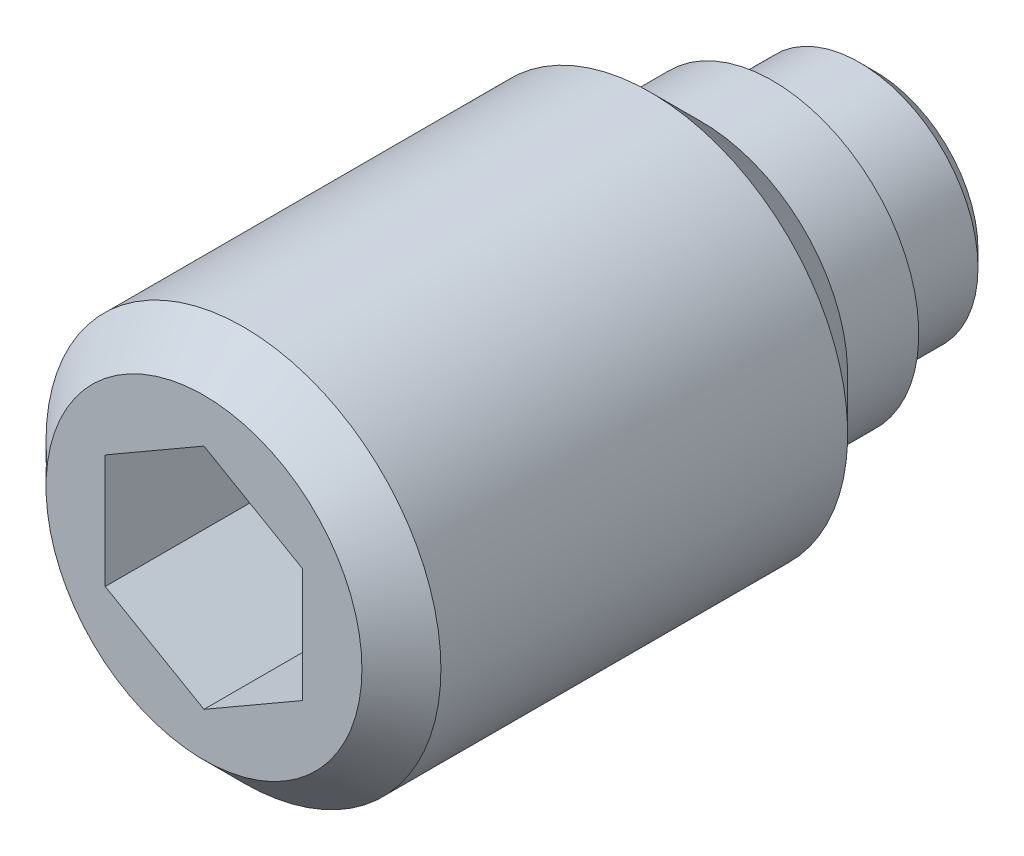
ISO-10303-21;
HEADER;
FILE_DESCRIPTION(('STEP AP214'),'2;1');
FILE_NAME('part.step','',(''),(''),'','','');
FILE_SCHEMA(('AUTOMOTIVE_DESIGN { 1 0 10303 214 1 1 1 1 }'));
ENDSEC;
DATA;
#1=APPLICATION_CONTEXT('core data for automotive mechanical design processes');
#2=APPLICATION_PROTOCOL_DEFINITION('international standard','automotive_design',2000,#1);
#3=PRODUCT_CONTEXT('',#1,'mechanical');
#4=PRODUCT('Part','Part','',(#3));
#5=PRODUCT_RELATED_PRODUCT_CATEGORY('part','',(#4));
#6=PRODUCT_DEFINITION_FORMATION('','',#4);
#7=PRODUCT_DEFINITION_CONTEXT('part definition',#1,'design');
#8=PRODUCT_DEFINITION('design','',#6,#7);
#9=PRODUCT_DEFINITION_SHAPE('','',#8);
#10=(LENGTH_UNIT() NAMED_UNIT(*) SI_UNIT(.MILLI.,.METRE.));
#11=(NAMED_UNIT(*) PLANE_ANGLE_UNIT() SI_UNIT($,.RADIAN.));
#12=(NAMED_UNIT(*) SI_UNIT($,.STERADIAN.) SOLID_ANGLE_UNIT());
#13=UNCERTAINTY_MEASURE_WITH_UNIT(LENGTH_MEASURE(1.E-05),#10,'distance_accuracy_value','');
#14=(GEOMETRIC_REPRESENTATION_CONTEXT(3) GLOBAL_UNCERTAINTY_ASSIGNED_CONTEXT((#13)) GLOBAL_UNIT_ASSIGNED_CONTEXT((#10,
#11,#12)) REPRESENTATION_CONTEXT('',''));
#15=CARTESIAN_POINT('',(0.,0.,0.));
#16=DIRECTION('',(0.,0.,1.));
#17=DIRECTION('',(1.,0.,0.));
#18=AXIS2_PLACEMENT_3D('',#15,#16,#17);
#19=CARTESIAN_POINT('',(0.,0.,1.3));
#20=DIRECTION('',(0.,0.,-1.));
#21=DIRECTION('',(-1.,0.,0.));
#22=AXIS2_PLACEMENT_3D('',#19,#20,#21);
#23=CYLINDRICAL_SURFACE('',#22,2.5);
#24=CARTESIAN_POINT('',(0.,0.,2.85));
#25=DIRECTION('',(0.,0.,-1.));
#26=DIRECTION('',(-1.,0.,0.));
#27=AXIS2_PLACEMENT_3D('',#24,#25,#26);
#28=CIRCLE('',#27,2.5);
#29=CARTESIAN_POINT('',(-2.5,0.,2.85));
#30=VERTEX_POINT('',#29);
#31=EDGE_CURVE('E9',#30,#30,#28,.T.);
#32=ORIENTED_EDGE('',*,*,#31,.F.);
#33=EDGE_LOOP('',(#32));
#34=FACE_BOUND('',#33,.T.);
#35=CARTESIAN_POINT('',(0.,0.,8.));
#36=DIRECTION('',(0.,0.,1.));
#37=DIRECTION('',(1.,0.,0.));
#38=AXIS2_PLACEMENT_3D('',#35,#36,#37);
#39=CIRCLE('',#38,2.5);
#40=CARTESIAN_POINT('',(2.5,0.,8.));
#41=VERTEX_POINT('',#40);
#42=EDGE_CURVE('E115',#41,#41,#39,.T.);
#43=ORIENTED_EDGE('',*,*,#42,.F.);
#44=EDGE_LOOP('',(#43));
#45=FACE_BOUND('',#44,.T.);
#46=ADVANCED_FACE('F14',(#34,#45),#23,.T.);
#47=CARTESIAN_POINT('',(0.,0.,2.85));
#48=DIRECTION('',(0.,0.,1.));
#49=DIRECTION('',(1.,0.,0.));
#50=AXIS2_PLACEMENT_3D('',#47,#48,#49);
#51=CONICAL_SURFACE('',#50,2.5,0.785398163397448);
#52=ORIENTED_EDGE('',*,*,#31,.T.);
#53=EDGE_LOOP('',(#52));
#54=FACE_BOUND('',#53,.T.);
#55=CARTESIAN_POINT('',(0.,0.,2.2));
#56=DIRECTION('',(0.,0.,-1.));
#57=DIRECTION('',(-1.,0.,0.));
#58=AXIS2_PLACEMENT_3D('',#55,#56,#57);
#59=CIRCLE('',#58,1.85);
#60=CARTESIAN_POINT('',(-1.85,0.,2.2));
#61=VERTEX_POINT('',#60);
#62=EDGE_CURVE('E21',#61,#61,#59,.T.);
#63=ORIENTED_EDGE('',*,*,#62,.F.);
#64=EDGE_LOOP('',(#63));
#65=FACE_BOUND('',#64,.T.);
#66=ADVANCED_FACE('F143',(#54,#65),#51,.T.);
#67=CARTESIAN_POINT('',(0.,0.,1.3));
#68=DIRECTION('',(0.,0.,-1.));
#69=DIRECTION('',(-1.,0.,0.));
#70=AXIS2_PLACEMENT_3D('',#67,#68,#69);
#71=CYLINDRICAL_SURFACE('',#70,1.85);
#72=ORIENTED_EDGE('',*,*,#62,.T.);
#73=EDGE_LOOP('',(#72));
#74=FACE_BOUND('',#73,.T.);
#75=CARTESIAN_POINT('',(0.,0.,1.3));
#76=DIRECTION('',(0.,0.,-1.));
#77=DIRECTION('',(-1.,0.,0.));
#78=AXIS2_PLACEMENT_3D('',#75,#76,#77);
#79=CIRCLE('',#78,1.85);
#80=CARTESIAN_POINT('',(-1.85,0.,1.3));
#81=VERTEX_POINT('',#80);
#82=EDGE_CURVE('E135',#81,#81,#79,.T.);
#83=ORIENTED_EDGE('',*,*,#82,.F.);
#84=EDGE_LOOP('',(#83));
#85=FACE_BOUND('',#84,.T.);
#86=ADVANCED_FACE('F140',(#74,#85),#71,.T.);
#87=CARTESIAN_POINT('',(0.,1.85,1.3));
#88=DIRECTION('',(0.,0.,1.));
#89=DIRECTION('',(1.,0.,0.));
#90=AXIS2_PLACEMENT_3D('',#87,#88,#89);
#91=PLANE('',#90);
#92=ORIENTED_EDGE('',*,*,#82,.T.);
#93=EDGE_LOOP('',(#92));
#94=FACE_BOUND('',#93,.T.);
#95=CARTESIAN_POINT('',(0.,0.,1.3));
#96=DIRECTION('',(0.,0.,-1.));
#97=DIRECTION('',(-1.,0.,0.));
#98=AXIS2_PLACEMENT_3D('',#95,#96,#97);
#99=CIRCLE('',#98,1.5);
#100=CARTESIAN_POINT('',(-1.5,0.,1.3));
#101=VERTEX_POINT('',#100);
#102=EDGE_CURVE('E132',#101,#101,#99,.T.);
#103=ORIENTED_EDGE('',*,*,#102,.F.);
#104=EDGE_LOOP('',(#103));
#105=FACE_BOUND('',#104,.T.);
#106=ADVANCED_FACE('F151',(#94,#105),#91,.F.);
#107=CARTESIAN_POINT('',(0.,0.,0.));
#108=DIRECTION('',(0.,0.,-1.));
#109=DIRECTION('',(-1.,0.,0.));
#110=AXIS2_PLACEMENT_3D('',#107,#108,#109);
#111=CYLINDRICAL_SURFACE('',#110,1.5);
#112=CARTESIAN_POINT('',(0.,0.,0.2));
#113=DIRECTION('',(0.,0.,-1.));
#114=DIRECTION('',(-1.,0.,0.));
#115=AXIS2_PLACEMENT_3D('',#112,#113,#114);
#116=CIRCLE('',#115,1.5);
#117=CARTESIAN_POINT('',(-1.5,0.,0.2));
#118=VERTEX_POINT('',#117);
#119=EDGE_CURVE('E129',#118,#118,#116,.T.);
#120=ORIENTED_EDGE('',*,*,#119,.F.);
#121=EDGE_LOOP('',(#120));
#122=FACE_BOUND('',#121,.T.);
#123=ORIENTED_EDGE('',*,*,#102,.T.);
#124=EDGE_LOOP('',(#123));
#125=FACE_BOUND('',#124,.T.);
#126=ADVANCED_FACE('F157',(#122,#125),#111,.T.);
#127=CARTESIAN_POINT('',(0.,0.,0.2));
#128=DIRECTION('',(0.,0.,1.));
#129=DIRECTION('',(1.,0.,0.));
#130=AXIS2_PLACEMENT_3D('',#127,#128,#129);
#131=CONICAL_SURFACE('',#130,1.5,0.785398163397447);
#132=CARTESIAN_POINT('',(0.,0.,0.));
#133=DIRECTION('',(0.,0.,-1.));
#134=DIRECTION('',(-1.,0.,0.));
#135=AXIS2_PLACEMENT_3D('',#132,#133,#134);
#136=CIRCLE('',#135,1.3);
#137=CARTESIAN_POINT('',(-1.3,0.,0.));
#138=VERTEX_POINT('',#137);
#139=EDGE_CURVE('E126',#138,#138,#136,.T.);
#140=ORIENTED_EDGE('',*,*,#139,.F.);
#141=EDGE_LOOP('',(#140));
#142=FACE_BOUND('',#141,.T.);
#143=ORIENTED_EDGE('',*,*,#119,.T.);
#144=EDGE_LOOP('',(#143));
#145=FACE_BOUND('',#144,.T.);
#146=ADVANCED_FACE('F161',(#142,#145),#131,.T.);
#147=CARTESIAN_POINT('',(0.,1.3,0.));
#148=DIRECTION('',(0.,0.,1.));
#149=DIRECTION('',(1.,0.,0.));
#150=AXIS2_PLACEMENT_3D('',#147,#148,#149);
#151=PLANE('',#150);
#152=ORIENTED_EDGE('',*,*,#139,.T.);
#153=EDGE_LOOP('',(#152));
#154=FACE_BOUND('',#153,.T.);
#155=ADVANCED_FACE('F165',(#154),#151,.F.);
#156=CARTESIAN_POINT('',(0.,0.,8.5));
#157=DIRECTION('',(0.,0.,1.));
#158=DIRECTION('',(1.,0.,0.));
#159=AXIS2_PLACEMENT_3D('',#156,#157,#158);
#160=PLANE('',#159);
#161=DIRECTION('',(0.866025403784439,-0.5,0.));
#162=VECTOR('',#161,1.);
#163=CARTESIAN_POINT('',(-1.25,-0.721687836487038,8.5));
#164=LINE('',#163,#162);
#165=CARTESIAN_POINT('',(-1.25,-0.721687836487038,8.5));
#166=VERTEX_POINT('',#165);
#167=CARTESIAN_POINT('',(0.,-1.44337567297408,8.5));
#168=VERTEX_POINT('',#167);
#169=EDGE_CURVE('E28',#166,#168,#164,.T.);
#170=ORIENTED_EDGE('',*,*,#169,.F.);
#171=DIRECTION('',(0.,-1.,0.));
#172=VECTOR('',#171,1.);
#173=CARTESIAN_POINT('',(-1.25,0.721687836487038,8.5));
#174=LINE('',#173,#172);
#175=CARTESIAN_POINT('',(-1.25,0.721687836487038,8.5));
#176=VERTEX_POINT('',#175);
#177=EDGE_CURVE('E111',#176,#166,#174,.T.);
#178=ORIENTED_EDGE('',*,*,#177,.F.);
#179=DIRECTION('',(-0.866025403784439,-0.5,0.));
#180=VECTOR('',#179,1.);
#181=CARTESIAN_POINT('',(0.,1.44337567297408,8.5));
#182=LINE('',#181,#180);
#183=CARTESIAN_POINT('',(0.,1.44337567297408,8.5));
#184=VERTEX_POINT('',#183);
#185=EDGE_CURVE('E109',#184,#176,#182,.T.);
#186=ORIENTED_EDGE('',*,*,#185,.F.);
#187=DIRECTION('',(-0.866025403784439,0.5,0.));
#188=VECTOR('',#187,1.);
#189=CARTESIAN_POINT('',(1.25,0.721687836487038,8.5));
#190=LINE('',#189,#188);
#191=CARTESIAN_POINT('',(1.25,0.721687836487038,8.5));
#192=VERTEX_POINT('',#191);
#193=EDGE_CURVE('E76',#192,#184,#190,.T.);
#194=ORIENTED_EDGE('',*,*,#193,.F.);
#195=DIRECTION('',(0.,1.,0.));
#196=VECTOR('',#195,1.);
#197=CARTESIAN_POINT('',(1.25,-0.721687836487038,8.5));
#198=LINE('',#197,#196);
#199=CARTESIAN_POINT('',(1.25,-0.721687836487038,8.5));
#200=VERTEX_POINT('',#199);
#201=EDGE_CURVE('E105',#200,#192,#198,.T.);
#202=ORIENTED_EDGE('',*,*,#201,.F.);
#203=DIRECTION('',(0.866025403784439,0.5,0.));
#204=VECTOR('',#203,1.);
#205=CARTESIAN_POINT('',(0.,-1.44337567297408,8.5));
#206=LINE('',#205,#204);
#207=EDGE_CURVE('E102',#168,#200,#206,.T.);
#208=ORIENTED_EDGE('',*,*,#207,.F.);
#209=EDGE_LOOP('',(#170,#178,#186,#194,#202,#208));
#210=FACE_BOUND('',#209,.T.);
#211=CARTESIAN_POINT('',(0.,0.,8.5));
#212=DIRECTION('',(0.,0.,1.));
#213=DIRECTION('',(1.,0.,0.));
#214=AXIS2_PLACEMENT_3D('',#211,#212,#213);
#215=CIRCLE('',#214,2.);
#216=CARTESIAN_POINT('',(2.,0.,8.5));
#217=VERTEX_POINT('',#216);
#218=EDGE_CURVE('E123',#217,#217,#215,.T.);
#219=ORIENTED_EDGE('',*,*,#218,.T.);
#220=EDGE_LOOP('',(#219));
#221=FACE_BOUND('',#220,.T.);
#222=ADVANCED_FACE('F169',(#210,#221),#160,.T.);
#223=CARTESIAN_POINT('',(0.,0.,8.5));
#224=DIRECTION('',(0.,0.,-1.));
#225=DIRECTION('',(-1.,0.,0.));
#226=AXIS2_PLACEMENT_3D('',#223,#224,#225);
#227=CONICAL_SURFACE('',#226,2.,0.785398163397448);
#228=ORIENTED_EDGE('',*,*,#42,.T.);
#229=EDGE_LOOP('',(#228));
#230=FACE_BOUND('',#229,.T.);
#231=ORIENTED_EDGE('',*,*,#218,.F.);
#232=EDGE_LOOP('',(#231));
#233=FACE_BOUND('',#232,.T.);
#234=ADVANCED_FACE('F173',(#230,#233),#227,.T.);
#235=CARTESIAN_POINT('',(-1.25,-0.721687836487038,5.5));
#236=DIRECTION('',(-0.5,-0.866025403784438,0.));
#237=DIRECTION('',(0.866025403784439,-0.5,0.));
#238=AXIS2_PLACEMENT_3D('',#235,#236,#237);
#239=PLANE('',#238);
#240=ORIENTED_EDGE('',*,*,#169,.T.);
#241=DIRECTION('',(0.,0.,1.));
#242=VECTOR('',#241,1.);
#243=CARTESIAN_POINT('',(0.,-1.44337567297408,5.5));
#244=LINE('',#243,#242);
#245=CARTESIAN_POINT('',(0.,-1.44337567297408,5.5));
#246=VERTEX_POINT('',#245);
#247=EDGE_CURVE('E58',#246,#168,#244,.T.);
#248=ORIENTED_EDGE('',*,*,#247,.F.);
#249=DIRECTION('',(0.866025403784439,-0.5,0.));
#250=VECTOR('',#249,1.);
#251=CARTESIAN_POINT('',(-1.25,-0.721687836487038,5.5));
#252=LINE('',#251,#250);
#253=CARTESIAN_POINT('',(-1.25,-0.721687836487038,5.5));
#254=VERTEX_POINT('',#253);
#255=EDGE_CURVE('E113',#254,#246,#252,.T.);
#256=ORIENTED_EDGE('',*,*,#255,.F.);
#257=DIRECTION('',(0.,0.,1.));
#258=VECTOR('',#257,1.);
#259=CARTESIAN_POINT('',(-1.25,-0.721687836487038,5.5));
#260=LINE('',#259,#258);
#261=EDGE_CURVE('E36',#254,#166,#260,.T.);
#262=ORIENTED_EDGE('',*,*,#261,.T.);
#263=EDGE_LOOP('',(#240,#248,#256,#262));
#264=FACE_BOUND('',#263,.T.);
#265=ADVANCED_FACE('F177',(#264),#239,.F.);
#266=CARTESIAN_POINT('',(-1.25,0.721687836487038,5.5));
#267=DIRECTION('',(-1.,0.,0.));
#268=DIRECTION('',(0.,0.,1.));
#269=AXIS2_PLACEMENT_3D('',#266,#267,#268);
#270=PLANE('',#269);
#271=ORIENTED_EDGE('',*,*,#177,.T.);
#272=ORIENTED_EDGE('',*,*,#261,.F.);
#273=DIRECTION('',(0.,-1.,0.));
#274=VECTOR('',#273,1.);
#275=CARTESIAN_POINT('',(-1.25,0.721687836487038,5.5));
#276=LINE('',#275,#274);
#277=CARTESIAN_POINT('',(-1.25,0.721687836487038,5.5));
#278=VERTEX_POINT('',#277);
#279=EDGE_CURVE('E88',#278,#254,#276,.T.);
#280=ORIENTED_EDGE('',*,*,#279,.F.);
#281=DIRECTION('',(0.,0.,1.));
#282=VECTOR('',#281,1.);
#283=CARTESIAN_POINT('',(-1.25,0.721687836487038,5.5));
#284=LINE('',#283,#282);
#285=EDGE_CURVE('E80',#278,#176,#284,.T.);
#286=ORIENTED_EDGE('',*,*,#285,.T.);
#287=EDGE_LOOP('',(#271,#272,#280,#286));
#288=FACE_BOUND('',#287,.T.);
#289=ADVANCED_FACE('F181',(#288),#270,.F.);
#290=CARTESIAN_POINT('',(0.,1.44337567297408,5.5));
#291=DIRECTION('',(-0.5,0.866025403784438,0.));
#292=DIRECTION('',(-0.866025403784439,-0.5,0.));
#293=AXIS2_PLACEMENT_3D('',#290,#291,#292);
#294=PLANE('',#293);
#295=ORIENTED_EDGE('',*,*,#185,.T.);
#296=ORIENTED_EDGE('',*,*,#285,.F.);
#297=DIRECTION('',(-0.866025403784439,-0.5,0.));
#298=VECTOR('',#297,1.);
#299=CARTESIAN_POINT('',(0.,1.44337567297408,5.5));
#300=LINE('',#299,#298);
#301=CARTESIAN_POINT('',(0.,1.44337567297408,5.5));
#302=VERTEX_POINT('',#301);
#303=EDGE_CURVE('E84',#302,#278,#300,.T.);
#304=ORIENTED_EDGE('',*,*,#303,.F.);
#305=DIRECTION('',(0.,0.,1.));
#306=VECTOR('',#305,1.);
#307=CARTESIAN_POINT('',(0.,1.44337567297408,5.5));
#308=LINE('',#307,#306);
#309=EDGE_CURVE('E69',#302,#184,#308,.T.);
#310=ORIENTED_EDGE('',*,*,#309,.T.);
#311=EDGE_LOOP('',(#295,#296,#304,#310));
#312=FACE_BOUND('',#311,.T.);
#313=ADVANCED_FACE('F85',(#312),#294,.F.);
#314=CARTESIAN_POINT('',(1.25,0.721687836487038,5.5));
#315=DIRECTION('',(0.5,0.866025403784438,0.));
#316=DIRECTION('',(-0.866025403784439,0.5,0.));
#317=AXIS2_PLACEMENT_3D('',#314,#315,#316);
#318=PLANE('',#317);
#319=ORIENTED_EDGE('',*,*,#193,.T.);
#320=ORIENTED_EDGE('',*,*,#309,.F.);
#321=DIRECTION('',(-0.866025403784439,0.5,0.));
#322=VECTOR('',#321,1.);
#323=CARTESIAN_POINT('',(1.25,0.721687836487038,5.5));
#324=LINE('',#323,#322);
#325=CARTESIAN_POINT('',(1.25,0.721687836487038,5.5));
#326=VERTEX_POINT('',#325);
#327=EDGE_CURVE('E73',#326,#302,#324,.T.);
#328=ORIENTED_EDGE('',*,*,#327,.F.);
#329=DIRECTION('',(0.,0.,1.));
#330=VECTOR('',#329,1.);
#331=CARTESIAN_POINT('',(1.25,0.721687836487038,5.5));
#332=LINE('',#331,#330);
#333=EDGE_CURVE('E81',#326,#192,#332,.T.);
#334=ORIENTED_EDGE('',*,*,#333,.T.);
#335=EDGE_LOOP('',(#319,#320,#328,#334));
#336=FACE_BOUND('',#335,.T.);
#337=ADVANCED_FACE('F71',(#336),#318,.F.);
#338=CARTESIAN_POINT('',(1.25,-0.721687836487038,5.5));
#339=DIRECTION('',(1.,0.,0.));
#340=DIRECTION('',(0.,0.,-1.));
#341=AXIS2_PLACEMENT_3D('',#338,#339,#340);
#342=PLANE('',#341);
#343=ORIENTED_EDGE('',*,*,#201,.T.);
#344=ORIENTED_EDGE('',*,*,#333,.F.);
#345=DIRECTION('',(0.,1.,0.));
#346=VECTOR('',#345,1.);
#347=CARTESIAN_POINT('',(1.25,-0.721687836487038,5.5));
#348=LINE('',#347,#346);
#349=CARTESIAN_POINT('',(1.25,-0.721687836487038,5.5));
#350=VERTEX_POINT('',#349);
#351=EDGE_CURVE('E94',#350,#326,#348,.T.);
#352=ORIENTED_EDGE('',*,*,#351,.F.);
#353=DIRECTION('',(0.,0.,1.));
#354=VECTOR('',#353,1.);
#355=CARTESIAN_POINT('',(1.25,-0.721687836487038,5.5));
#356=LINE('',#355,#354);
#357=EDGE_CURVE('E118',#350,#200,#356,.T.);
#358=ORIENTED_EDGE('',*,*,#357,.T.);
#359=EDGE_LOOP('',(#343,#344,#352,#358));
#360=FACE_BOUND('',#359,.T.);
#361=ADVANCED_FACE('F185',(#360),#342,.F.);
#362=CARTESIAN_POINT('',(0.,-1.44337567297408,5.5));
#363=DIRECTION('',(0.5,-0.866025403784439,0.));
#364=DIRECTION('',(0.866025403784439,0.5,0.));
#365=AXIS2_PLACEMENT_3D('',#362,#363,#364);
#366=PLANE('',#365);
#367=ORIENTED_EDGE('',*,*,#207,.T.);
#368=ORIENTED_EDGE('',*,*,#357,.F.);
#369=DIRECTION('',(0.866025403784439,0.5,0.));
#370=VECTOR('',#369,1.);
#371=CARTESIAN_POINT('',(0.,-1.44337567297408,5.5));
#372=LINE('',#371,#370);
#373=EDGE_CURVE('E96',#246,#350,#372,.T.);
#374=ORIENTED_EDGE('',*,*,#373,.F.);
#375=ORIENTED_EDGE('',*,*,#247,.T.);
#376=EDGE_LOOP('',(#367,#368,#374,#375));
#377=FACE_BOUND('',#376,.T.);
#378=ADVANCED_FACE('F182',(#377),#366,.F.);
#379=CARTESIAN_POINT('',(0.,0.,5.5));
#380=DIRECTION('',(0.,0.,1.));
#381=DIRECTION('',(1.,0.,0.));
#382=AXIS2_PLACEMENT_3D('',#379,#380,#381);
#383=PLANE('',#382);
#384=ORIENTED_EDGE('',*,*,#255,.T.);
#385=ORIENTED_EDGE('',*,*,#373,.T.);
#386=ORIENTED_EDGE('',*,*,#351,.T.);
#387=ORIENTED_EDGE('',*,*,#327,.T.);
#388=ORIENTED_EDGE('',*,*,#303,.T.);
#389=ORIENTED_EDGE('',*,*,#279,.T.);
#390=EDGE_LOOP('',(#384,#385,#386,#387,#388,#389));
#391=FACE_BOUND('',#390,.T.);
#392=ADVANCED_FACE('F91',(#391),#383,.T.);
#393=CLOSED_SHELL('',(#46,#66,#86,#106,#126,#146,#155,#222,#234,#265,#289,#313,#337,#361,#378,#392));
#394=MANIFOLD_SOLID_BREP('B1',#393);
#395=ADVANCED_BREP_SHAPE_REPRESENTATION('',(#18,#394),#14);
#396=SHAPE_DEFINITION_REPRESENTATION(#9,#395);
ENDSEC;
END-ISO-10303-21;
